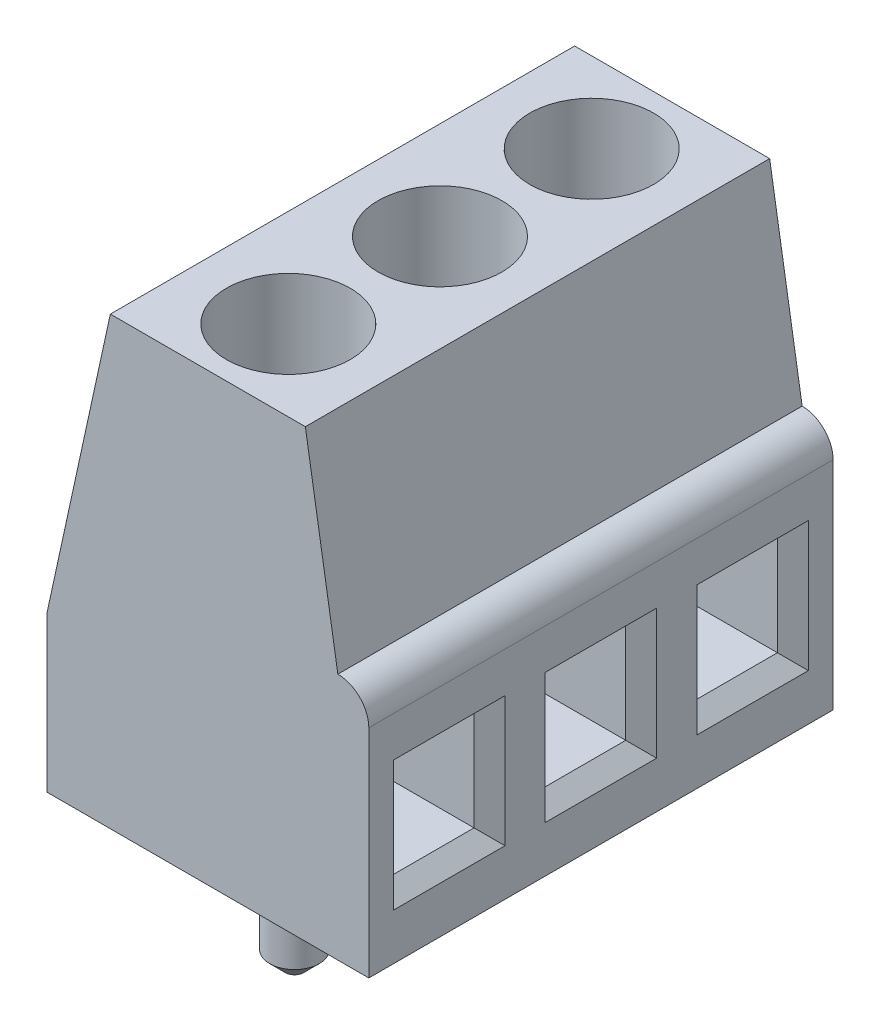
from build123d import *

# Parameters (mm, degrees)
RESSALTO_EXTRUS_O1_DEPTH = 15
ESBO_O2_W                = 2.6
ESBO_O2_H                = 3.2
CORTE_EXTRUS_O1_DEPTH    = 5
CHANFRO1_SIZE            = 0.5
ESBO_O3_R                = 0.8
RESSALTO_EXTRUS_O2_DEPTH = 3.5
CHANFRO3_SIZE            = 0.5
ESBO_O4_R                = 2
CORTE_EXTRUS_O2_DEPTH    = 3


with BuildPart() as part:
    # Esbo_o1 → Ressalto-extrus_o1 (new body)
    with BuildSketch(Plane.XY):
        with BuildLine():
            Line((-10.4, -8.689473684), (0, -8.689473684))
            Line((0, -8.689473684), (0, -1.689473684))
            ThreePointArc((0, -1.689473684), (-0.292893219, -0.982366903), (-1, -0.689473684))
            Line((-1, -0.689473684), (-2.05, 5.710526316))
            Line((-2.05, 5.710526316), (-8.35, 5.710526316))
            Line((-8.35, 5.710526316), (-10.4, -3.689473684))
            Line((-10.4, -3.689473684), (-10.4, -8.689473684))
        make_face()
    extrude(amount=RESSALTO_EXTRUS_O1_DEPTH)

    # Esbo_o2 → Corte-extrus_o1 (cut)
    with BuildSketch(Plane(origin=(0, 0, 0), x_dir=(0, 0, -1), z_dir=(1, 0, 0))):
        with Locations((-12.4, -5.089473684)):
            Rectangle(ESBO_O2_W, ESBO_O2_H)
        with Locations((-7.5, -5.089473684)):
            Rectangle(ESBO_O2_W, ESBO_O2_H)
        with Locations((-2.6, -5.089473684)):
            Rectangle(ESBO_O2_W, ESBO_O2_H)
    extrude(amount=-CORTE_EXTRUS_O1_DEPTH, mode=Mode.SUBTRACT)

    # Chanfro1
    chanfro1_edges = [part.edges().sort_by_distance(p)[0] for p in [
        (0, -5.089473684, 13.7),
        (0, -6.689473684, 12.4),
        (0, -5.089473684, 11.1),
        (0, -3.489473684, 12.4),
        (0, -5.089473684, 8.8),
        (0, -6.689473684, 7.5),
        (0, -5.089473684, 6.2),
        (0, -3.489473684, 7.5),
        (0, -5.089473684, 3.9),
        (0, -6.689473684, 2.6),
        (0, -5.089473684, 1.3),
        (0, -3.489473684, 2.6),
    ]]
    chamfer(chanfro1_edges, length=CHANFRO1_SIZE)

    # Esbo_o3 → Ressalto-extrus_o2 (add)
    with BuildSketch(Plane(origin=(0, -8.689473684, 0), x_dir=(-1, 0, 0), z_dir=(0, -1, 0))):
        with Locations(Location((5, -12.4, 0), (0, 0, 270))):
            Circle(ESBO_O3_R)
        with Locations(Location((5, -7.5, 0), (0, 0, 270))):
            Circle(ESBO_O3_R)
        with Locations(Location((5, -2.6, 0), (0, 0, 270))):
            Circle(ESBO_O3_R)
    extrude(amount=RESSALTO_EXTRUS_O2_DEPTH)

    # Chanfro3
    chanfro3_edges = [part.edges().sort_by_distance(p)[0] for p in [
        (-5, -12.189473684, 11.6),
        (-5, -12.189473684, 6.7),
        (-5, -12.189473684, 1.8),
    ]]
    chamfer(chanfro3_edges, length=CHANFRO3_SIZE)

    # Esbo_o4 → Corte-extrus_o2 (cut)
    with BuildSketch(Plane(origin=(0, 5.710526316, 0), x_dir=(1, 0, 0), z_dir=(0, 1, 0))):
        with Locations(Location((-5.2, -12.4, 0), (0, 0, 270))):
            Circle(ESBO_O4_R)
        with Locations(Location((-5.2, -7.5, 0), (0, 0, 270))):
            Circle(ESBO_O4_R)
        with Locations(Location((-5.2, -2.6, 0), (0, 0, 270))):
            Circle(ESBO_O4_R)
    extrude(amount=-CORTE_EXTRUS_O2_DEPTH, mode=Mode.SUBTRACT)


solid = part.part
